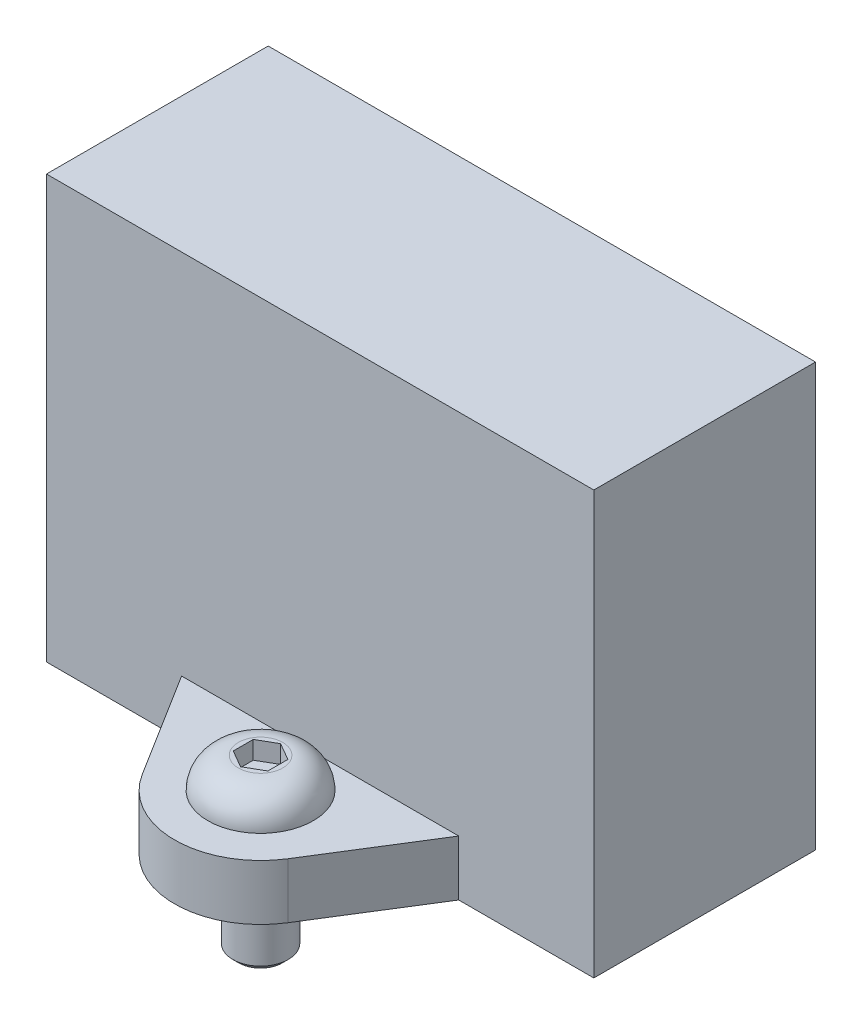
ISO-10303-21;
HEADER;
FILE_DESCRIPTION(('STEP AP214'),'2;1');
FILE_NAME('part.step','',(''),(''),'','','');
FILE_SCHEMA(('AUTOMOTIVE_DESIGN { 1 0 10303 214 1 1 1 1 }'));
ENDSEC;
DATA;
#1=APPLICATION_CONTEXT('core data for automotive mechanical design processes');
#2=APPLICATION_PROTOCOL_DEFINITION('international standard','automotive_design',2000,#1);
#3=PRODUCT_CONTEXT('',#1,'mechanical');
#4=PRODUCT('Part','Part','',(#3));
#5=PRODUCT_RELATED_PRODUCT_CATEGORY('part','',(#4));
#6=PRODUCT_DEFINITION_FORMATION('','',#4);
#7=PRODUCT_DEFINITION_CONTEXT('part definition',#1,'design');
#8=PRODUCT_DEFINITION('design','',#6,#7);
#9=PRODUCT_DEFINITION_SHAPE('','',#8);
#10=(LENGTH_UNIT() NAMED_UNIT(*) SI_UNIT(.MILLI.,.METRE.));
#11=(NAMED_UNIT(*) PLANE_ANGLE_UNIT() SI_UNIT($,.RADIAN.));
#12=(NAMED_UNIT(*) SI_UNIT($,.STERADIAN.) SOLID_ANGLE_UNIT());
#13=UNCERTAINTY_MEASURE_WITH_UNIT(LENGTH_MEASURE(1.E-05),#10,'distance_accuracy_value','');
#14=(GEOMETRIC_REPRESENTATION_CONTEXT(3) GLOBAL_UNCERTAINTY_ASSIGNED_CONTEXT((#13)) GLOBAL_UNIT_ASSIGNED_CONTEXT((#10,
#11,#12)) REPRESENTATION_CONTEXT('',''));
#15=CARTESIAN_POINT('',(0.,0.,0.));
#16=DIRECTION('',(0.,0.,1.));
#17=DIRECTION('',(1.,0.,0.));
#18=AXIS2_PLACEMENT_3D('',#15,#16,#17);
#19=CARTESIAN_POINT('',(-19.75,30.5,0.));
#20=DIRECTION('',(0.,0.,-1.));
#21=DIRECTION('',(-1.,0.,0.));
#22=AXIS2_PLACEMENT_3D('',#19,#20,#21);
#23=PLANE('',#22);
#24=DIRECTION('',(0.,-1.,0.));
#25=VECTOR('',#24,1.);
#26=CARTESIAN_POINT('',(-10.,4.,0.));
#27=LINE('',#26,#25);
#28=CARTESIAN_POINT('',(-10.,4.,0.));
#29=VERTEX_POINT('',#28);
#30=CARTESIAN_POINT('',(-10.,0.,0.));
#31=VERTEX_POINT('',#30);
#32=EDGE_CURVE('E224',#29,#31,#27,.T.);
#33=ORIENTED_EDGE('',*,*,#32,.F.);
#34=DIRECTION('',(-1.,0.,0.));
#35=VECTOR('',#34,1.);
#36=CARTESIAN_POINT('',(10.,4.,0.));
#37=LINE('',#36,#35);
#38=CARTESIAN_POINT('',(10.,4.,0.));
#39=VERTEX_POINT('',#38);
#40=EDGE_CURVE('E197',#39,#29,#37,.T.);
#41=ORIENTED_EDGE('',*,*,#40,.F.);
#42=DIRECTION('',(0.,-1.,0.));
#43=VECTOR('',#42,1.);
#44=CARTESIAN_POINT('',(10.,4.,0.));
#45=LINE('',#44,#43);
#46=CARTESIAN_POINT('',(10.,0.,0.));
#47=VERTEX_POINT('',#46);
#48=EDGE_CURVE('E206',#39,#47,#45,.T.);
#49=ORIENTED_EDGE('',*,*,#48,.T.);
#50=DIRECTION('',(1.,0.,0.));
#51=VECTOR('',#50,1.);
#52=CARTESIAN_POINT('',(-19.75,0.,0.));
#53=LINE('',#52,#51);
#54=CARTESIAN_POINT('',(19.75,0.,0.));
#55=VERTEX_POINT('',#54);
#56=EDGE_CURVE('E216',#47,#55,#53,.T.);
#57=ORIENTED_EDGE('',*,*,#56,.T.);
#58=DIRECTION('',(0.,-1.,0.));
#59=VECTOR('',#58,1.);
#60=CARTESIAN_POINT('',(19.75,30.5,0.));
#61=LINE('',#60,#59);
#62=CARTESIAN_POINT('',(19.75,30.5,0.));
#63=VERTEX_POINT('',#62);
#64=EDGE_CURVE('E25',#63,#55,#61,.T.);
#65=ORIENTED_EDGE('',*,*,#64,.F.);
#66=DIRECTION('',(1.,0.,0.));
#67=VECTOR('',#66,1.);
#68=CARTESIAN_POINT('',(-19.75,30.5,0.));
#69=LINE('',#68,#67);
#70=CARTESIAN_POINT('',(-19.75,30.5,0.));
#71=VERTEX_POINT('',#70);
#72=EDGE_CURVE('E242',#71,#63,#69,.T.);
#73=ORIENTED_EDGE('',*,*,#72,.F.);
#74=DIRECTION('',(0.,-1.,0.));
#75=VECTOR('',#74,1.);
#76=CARTESIAN_POINT('',(-19.75,30.5,0.));
#77=LINE('',#76,#75);
#78=CARTESIAN_POINT('',(-19.75,0.,0.));
#79=VERTEX_POINT('',#78);
#80=EDGE_CURVE('E11',#71,#79,#77,.T.);
#81=ORIENTED_EDGE('',*,*,#80,.T.);
#82=EDGE_CURVE('E254',#79,#31,#53,.T.);
#83=ORIENTED_EDGE('',*,*,#82,.T.);
#84=EDGE_LOOP('',(#33,#41,#49,#57,#65,#73,#81,#83));
#85=FACE_BOUND('',#84,.T.);
#86=ADVANCED_FACE('F16',(#85),#23,.F.);
#87=CARTESIAN_POINT('',(-19.75,30.5,-16.));
#88=DIRECTION('',(1.,0.,0.));
#89=DIRECTION('',(0.,0.,-1.));
#90=AXIS2_PLACEMENT_3D('',#87,#88,#89);
#91=PLANE('',#90);
#92=DIRECTION('',(0.,0.,1.));
#93=VECTOR('',#92,1.);
#94=CARTESIAN_POINT('',(-19.75,0.,-16.));
#95=LINE('',#94,#93);
#96=CARTESIAN_POINT('',(-19.75,0.,-16.));
#97=VERTEX_POINT('',#96);
#98=EDGE_CURVE('E226',#97,#79,#95,.T.);
#99=ORIENTED_EDGE('',*,*,#98,.T.);
#100=ORIENTED_EDGE('',*,*,#80,.F.);
#101=DIRECTION('',(0.,0.,1.));
#102=VECTOR('',#101,1.);
#103=CARTESIAN_POINT('',(-19.75,30.5,-16.));
#104=LINE('',#103,#102);
#105=CARTESIAN_POINT('',(-19.75,30.5,-16.));
#106=VERTEX_POINT('',#105);
#107=EDGE_CURVE('E239',#106,#71,#104,.T.);
#108=ORIENTED_EDGE('',*,*,#107,.F.);
#109=DIRECTION('',(0.,-1.,0.));
#110=VECTOR('',#109,1.);
#111=CARTESIAN_POINT('',(-19.75,30.5,-16.));
#112=LINE('',#111,#110);
#113=EDGE_CURVE('E248',#106,#97,#112,.T.);
#114=ORIENTED_EDGE('',*,*,#113,.T.);
#115=EDGE_LOOP('',(#99,#100,#108,#114));
#116=FACE_BOUND('',#115,.T.);
#117=ADVANCED_FACE('F18',(#116),#91,.F.);
#118=CARTESIAN_POINT('',(19.75,30.5,0.));
#119=DIRECTION('',(-1.,0.,0.));
#120=DIRECTION('',(0.,0.,1.));
#121=AXIS2_PLACEMENT_3D('',#118,#119,#120);
#122=PLANE('',#121);
#123=DIRECTION('',(0.,0.,-1.));
#124=VECTOR('',#123,1.);
#125=CARTESIAN_POINT('',(19.75,0.,0.));
#126=LINE('',#125,#124);
#127=CARTESIAN_POINT('',(19.75,0.,-16.));
#128=VERTEX_POINT('',#127);
#129=EDGE_CURVE('E251',#55,#128,#126,.T.);
#130=ORIENTED_EDGE('',*,*,#129,.T.);
#131=DIRECTION('',(0.,-1.,0.));
#132=VECTOR('',#131,1.);
#133=CARTESIAN_POINT('',(19.75,30.5,-16.));
#134=LINE('',#133,#132);
#135=CARTESIAN_POINT('',(19.75,30.5,-16.));
#136=VERTEX_POINT('',#135);
#137=EDGE_CURVE('E258',#136,#128,#134,.T.);
#138=ORIENTED_EDGE('',*,*,#137,.F.);
#139=DIRECTION('',(0.,0.,-1.));
#140=VECTOR('',#139,1.);
#141=CARTESIAN_POINT('',(19.75,30.5,0.));
#142=LINE('',#141,#140);
#143=EDGE_CURVE('E245',#63,#136,#142,.T.);
#144=ORIENTED_EDGE('',*,*,#143,.F.);
#145=ORIENTED_EDGE('',*,*,#64,.T.);
#146=EDGE_LOOP('',(#130,#138,#144,#145));
#147=FACE_BOUND('',#146,.T.);
#148=ADVANCED_FACE('F268',(#147),#122,.F.);
#149=CARTESIAN_POINT('',(19.75,30.5,-16.));
#150=DIRECTION('',(0.,0.,1.));
#151=DIRECTION('',(1.,0.,0.));
#152=AXIS2_PLACEMENT_3D('',#149,#150,#151);
#153=PLANE('',#152);
#154=DIRECTION('',(-1.,0.,0.));
#155=VECTOR('',#154,1.);
#156=CARTESIAN_POINT('',(19.75,0.,-16.));
#157=LINE('',#156,#155);
#158=EDGE_CURVE('E243',#128,#97,#157,.T.);
#159=ORIENTED_EDGE('',*,*,#158,.T.);
#160=ORIENTED_EDGE('',*,*,#113,.F.);
#161=DIRECTION('',(-1.,0.,0.));
#162=VECTOR('',#161,1.);
#163=CARTESIAN_POINT('',(19.75,30.5,-16.));
#164=LINE('',#163,#162);
#165=EDGE_CURVE('E247',#136,#106,#164,.T.);
#166=ORIENTED_EDGE('',*,*,#165,.F.);
#167=ORIENTED_EDGE('',*,*,#137,.T.);
#168=EDGE_LOOP('',(#159,#160,#166,#167));
#169=FACE_BOUND('',#168,.T.);
#170=ADVANCED_FACE('F274',(#169),#153,.F.);
#171=CARTESIAN_POINT('',(0.,30.5,0.));
#172=DIRECTION('',(0.,1.,0.));
#173=DIRECTION('',(0.,0.,1.));
#174=AXIS2_PLACEMENT_3D('',#171,#172,#173);
#175=PLANE('',#174);
#176=ORIENTED_EDGE('',*,*,#107,.T.);
#177=ORIENTED_EDGE('',*,*,#72,.T.);
#178=ORIENTED_EDGE('',*,*,#143,.T.);
#179=ORIENTED_EDGE('',*,*,#165,.T.);
#180=EDGE_LOOP('',(#176,#177,#178,#179));
#181=FACE_BOUND('',#180,.T.);
#182=ADVANCED_FACE('F281',(#181),#175,.T.);
#183=CARTESIAN_POINT('',(0.,0.,0.));
#184=DIRECTION('',(0.,1.,0.));
#185=DIRECTION('',(0.,0.,1.));
#186=AXIS2_PLACEMENT_3D('',#183,#184,#185);
#187=PLANE('',#186);
#188=CARTESIAN_POINT('',(0.,0.,4.3));
#189=DIRECTION('',(0.,1.,0.));
#190=DIRECTION('',(0.,0.,1.));
#191=AXIS2_PLACEMENT_3D('',#188,#189,#190);
#192=CIRCLE('',#191,2.15);
#193=CARTESIAN_POINT('',(0.,0.,6.45));
#194=VERTEX_POINT('',#193);
#195=EDGE_CURVE('E193',#194,#194,#192,.T.);
#196=ORIENTED_EDGE('',*,*,#195,.T.);
#197=EDGE_LOOP('',(#196));
#198=FACE_BOUND('',#197,.T.);
#199=ORIENTED_EDGE('',*,*,#98,.F.);
#200=ORIENTED_EDGE('',*,*,#158,.F.);
#201=ORIENTED_EDGE('',*,*,#129,.F.);
#202=ORIENTED_EDGE('',*,*,#56,.F.);
#203=DIRECTION('',(0.530092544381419,0.,-0.84793979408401));
#204=VECTOR('',#203,1.);
#205=CARTESIAN_POINT('',(5.25722672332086,0.,7.5865737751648));
#206=LINE('',#205,#204);
#207=CARTESIAN_POINT('',(5.25722672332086,0.,7.5865737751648));
#208=VERTEX_POINT('',#207);
#209=EDGE_CURVE('E41',#208,#47,#206,.T.);
#210=ORIENTED_EDGE('',*,*,#209,.F.);
#211=CARTESIAN_POINT('',(0.,0.,4.3));
#212=DIRECTION('',(0.,1.,0.));
#213=DIRECTION('',(0.,0.,1.));
#214=AXIS2_PLACEMENT_3D('',#211,#212,#213);
#215=CIRCLE('',#214,6.2);
#216=CARTESIAN_POINT('',(-5.25722672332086,0.,7.5865737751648));
#217=VERTEX_POINT('',#216);
#218=EDGE_CURVE('E207',#217,#208,#215,.T.);
#219=ORIENTED_EDGE('',*,*,#218,.F.);
#220=DIRECTION('',(0.530092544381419,0.,0.84793979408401));
#221=VECTOR('',#220,1.);
#222=CARTESIAN_POINT('',(-10.,0.,0.));
#223=LINE('',#222,#221);
#224=EDGE_CURVE('E196',#31,#217,#223,.T.);
#225=ORIENTED_EDGE('',*,*,#224,.F.);
#226=ORIENTED_EDGE('',*,*,#82,.F.);
#227=EDGE_LOOP('',(#199,#200,#201,#202,#210,#219,#225,#226));
#228=FACE_BOUND('',#227,.T.);
#229=ADVANCED_FACE('F276',(#198,#228),#187,.F.);
#230=CARTESIAN_POINT('',(-10.,4.,0.));
#231=DIRECTION('',(0.84793979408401,0.,-0.530092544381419));
#232=DIRECTION('',(-0.530092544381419,0.,-0.84793979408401));
#233=AXIS2_PLACEMENT_3D('',#230,#231,#232);
#234=PLANE('',#233);
#235=ORIENTED_EDGE('',*,*,#224,.T.);
#236=DIRECTION('',(0.,-1.,0.));
#237=VECTOR('',#236,1.);
#238=CARTESIAN_POINT('',(-5.25722672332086,4.,7.5865737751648));
#239=LINE('',#238,#237);
#240=CARTESIAN_POINT('',(-5.25722672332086,4.,7.5865737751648));
#241=VERTEX_POINT('',#240);
#242=EDGE_CURVE('E227',#241,#217,#239,.T.);
#243=ORIENTED_EDGE('',*,*,#242,.F.);
#244=DIRECTION('',(0.530092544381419,0.,0.84793979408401));
#245=VECTOR('',#244,1.);
#246=CARTESIAN_POINT('',(-10.,4.,0.));
#247=LINE('',#246,#245);
#248=EDGE_CURVE('E200',#29,#241,#247,.T.);
#249=ORIENTED_EDGE('',*,*,#248,.F.);
#250=ORIENTED_EDGE('',*,*,#32,.T.);
#251=EDGE_LOOP('',(#235,#243,#249,#250));
#252=FACE_BOUND('',#251,.T.);
#253=ADVANCED_FACE('F290',(#252),#234,.F.);
#254=CARTESIAN_POINT('',(0.,4.,4.3));
#255=DIRECTION('',(0.,-1.,0.));
#256=DIRECTION('',(0.,0.,-1.));
#257=AXIS2_PLACEMENT_3D('',#254,#255,#256);
#258=CYLINDRICAL_SURFACE('',#257,6.2);
#259=ORIENTED_EDGE('',*,*,#218,.T.);
#260=DIRECTION('',(0.,-1.,0.));
#261=VECTOR('',#260,1.);
#262=CARTESIAN_POINT('',(5.25722672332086,4.,7.5865737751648));
#263=LINE('',#262,#261);
#264=CARTESIAN_POINT('',(5.25722672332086,4.,7.5865737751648));
#265=VERTEX_POINT('',#264);
#266=EDGE_CURVE('E211',#265,#208,#263,.T.);
#267=ORIENTED_EDGE('',*,*,#266,.F.);
#268=CARTESIAN_POINT('',(0.,4.,4.3));
#269=DIRECTION('',(0.,1.,0.));
#270=DIRECTION('',(0.,0.,1.));
#271=AXIS2_PLACEMENT_3D('',#268,#269,#270);
#272=CIRCLE('',#271,6.2);
#273=EDGE_CURVE('E202',#241,#265,#272,.T.);
#274=ORIENTED_EDGE('',*,*,#273,.F.);
#275=ORIENTED_EDGE('',*,*,#242,.T.);
#276=EDGE_LOOP('',(#259,#267,#274,#275));
#277=FACE_BOUND('',#276,.T.);
#278=ADVANCED_FACE('F285',(#277),#258,.T.);
#279=CARTESIAN_POINT('',(5.25722672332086,4.,7.5865737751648));
#280=DIRECTION('',(-0.84793979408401,0.,-0.530092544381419));
#281=DIRECTION('',(-0.530092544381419,0.,0.84793979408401));
#282=AXIS2_PLACEMENT_3D('',#279,#280,#281);
#283=PLANE('',#282);
#284=ORIENTED_EDGE('',*,*,#209,.T.);
#285=ORIENTED_EDGE('',*,*,#48,.F.);
#286=DIRECTION('',(0.530092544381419,0.,-0.84793979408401));
#287=VECTOR('',#286,1.);
#288=CARTESIAN_POINT('',(5.25722672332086,4.,7.5865737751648));
#289=LINE('',#288,#287);
#290=EDGE_CURVE('E204',#265,#39,#289,.T.);
#291=ORIENTED_EDGE('',*,*,#290,.F.);
#292=ORIENTED_EDGE('',*,*,#266,.T.);
#293=EDGE_LOOP('',(#284,#285,#291,#292));
#294=FACE_BOUND('',#293,.T.);
#295=ADVANCED_FACE('F287',(#294),#283,.F.);
#296=CARTESIAN_POINT('',(0.,4.,4.3));
#297=DIRECTION('',(0.,1.,0.));
#298=DIRECTION('',(0.,0.,1.));
#299=AXIS2_PLACEMENT_3D('',#296,#297,#298);
#300=PLANE('',#299);
#301=CARTESIAN_POINT('',(0.,4.,4.3));
#302=DIRECTION('',(0.,1.,0.));
#303=DIRECTION('',(0.,0.,1.));
#304=AXIS2_PLACEMENT_3D('',#301,#302,#303);
#305=CIRCLE('',#304,3.8);
#306=CARTESIAN_POINT('',(0.,4.,8.1));
#307=VERTEX_POINT('',#306);
#308=EDGE_CURVE('E184',#307,#307,#305,.T.);
#309=ORIENTED_EDGE('',*,*,#308,.F.);
#310=EDGE_LOOP('',(#309));
#311=FACE_BOUND('',#310,.T.);
#312=ORIENTED_EDGE('',*,*,#40,.T.);
#313=ORIENTED_EDGE('',*,*,#248,.T.);
#314=ORIENTED_EDGE('',*,*,#273,.T.);
#315=ORIENTED_EDGE('',*,*,#290,.T.);
#316=EDGE_LOOP('',(#312,#313,#314,#315));
#317=FACE_BOUND('',#316,.T.);
#318=ADVANCED_FACE('F289',(#311,#317),#300,.T.);
#319=CARTESIAN_POINT('',(0.,0.,4.3));
#320=DIRECTION('',(0.,1.,0.));
#321=DIRECTION('',(0.,0.,1.));
#322=AXIS2_PLACEMENT_3D('',#319,#320,#321);
#323=CYLINDRICAL_SURFACE('',#322,2.15);
#324=CARTESIAN_POINT('',(0.,4.,4.3));
#325=DIRECTION('',(0.,1.,0.));
#326=DIRECTION('',(0.,0.,1.));
#327=AXIS2_PLACEMENT_3D('',#324,#325,#326);
#328=CIRCLE('',#327,2.15);
#329=CARTESIAN_POINT('',(0.,4.,6.45));
#330=VERTEX_POINT('',#329);
#331=EDGE_CURVE('E190',#330,#330,#328,.T.);
#332=ORIENTED_EDGE('',*,*,#331,.T.);
#333=EDGE_LOOP('',(#332));
#334=FACE_BOUND('',#333,.T.);
#335=ORIENTED_EDGE('',*,*,#195,.F.);
#336=EDGE_LOOP('',(#335));
#337=FACE_BOUND('',#336,.T.);
#338=ADVANCED_FACE('F359',(#334,#337),#323,.F.);
#339=CARTESIAN_POINT('',(1.5705,-6.,4.3));
#340=DIRECTION('',(0.,1.,0.));
#341=DIRECTION('',(0.,0.,1.));
#342=AXIS2_PLACEMENT_3D('',#339,#340,#341);
#343=PLANE('',#342);
#344=CARTESIAN_POINT('',(0.,-6.,4.3));
#345=DIRECTION('',(0.,1.,0.));
#346=DIRECTION('',(0.,0.,1.));
#347=AXIS2_PLACEMENT_3D('',#344,#345,#346);
#348=CIRCLE('',#347,1.5705);
#349=CARTESIAN_POINT('',(0.,-6.,5.8705));
#350=VERTEX_POINT('',#349);
#351=EDGE_CURVE('E168',#350,#350,#348,.T.);
#352=ORIENTED_EDGE('',*,*,#351,.F.);
#353=EDGE_LOOP('',(#352));
#354=FACE_BOUND('',#353,.T.);
#355=ADVANCED_FACE('F371',(#354),#343,.F.);
#356=CARTESIAN_POINT('',(0.,-6.,4.3));
#357=DIRECTION('',(0.,1.,0.));
#358=DIRECTION('',(0.,0.,1.));
#359=AXIS2_PLACEMENT_3D('',#356,#357,#358);
#360=CONICAL_SURFACE('',#359,1.5705,0.785398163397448);
#361=CARTESIAN_POINT('',(0.,-5.5705,4.3));
#362=DIRECTION('',(0.,1.,0.));
#363=DIRECTION('',(0.,0.,1.));
#364=AXIS2_PLACEMENT_3D('',#361,#362,#363);
#365=CIRCLE('',#364,2.);
#366=CARTESIAN_POINT('',(0.,-5.5705,6.3));
#367=VERTEX_POINT('',#366);
#368=EDGE_CURVE('E178',#367,#367,#365,.T.);
#369=ORIENTED_EDGE('',*,*,#368,.F.);
#370=EDGE_LOOP('',(#369));
#371=FACE_BOUND('',#370,.T.);
#372=ORIENTED_EDGE('',*,*,#351,.T.);
#373=EDGE_LOOP('',(#372));
#374=FACE_BOUND('',#373,.T.);
#375=ADVANCED_FACE('F383',(#371,#374),#360,.T.);
#376=CARTESIAN_POINT('',(0.,-6.,4.3));
#377=DIRECTION('',(0.,1.,0.));
#378=DIRECTION('',(0.,0.,1.));
#379=AXIS2_PLACEMENT_3D('',#376,#377,#378);
#380=CYLINDRICAL_SURFACE('',#379,2.);
#381=CARTESIAN_POINT('',(0.,4.,4.3));
#382=DIRECTION('',(0.,1.,0.));
#383=DIRECTION('',(0.,0.,1.));
#384=AXIS2_PLACEMENT_3D('',#381,#382,#383);
#385=CIRCLE('',#384,2.);
#386=CARTESIAN_POINT('',(0.,4.,6.3));
#387=VERTEX_POINT('',#386);
#388=EDGE_CURVE('E181',#387,#387,#385,.T.);
#389=ORIENTED_EDGE('',*,*,#388,.F.);
#390=EDGE_LOOP('',(#389));
#391=FACE_BOUND('',#390,.T.);
#392=ORIENTED_EDGE('',*,*,#368,.T.);
#393=EDGE_LOOP('',(#392));
#394=FACE_BOUND('',#393,.T.);
#395=ADVANCED_FACE('F393',(#391,#394),#380,.T.);
#396=CARTESIAN_POINT('',(3.8,4.,4.3));
#397=DIRECTION('',(0.,1.,0.));
#398=DIRECTION('',(0.,0.,1.));
#399=AXIS2_PLACEMENT_3D('',#396,#397,#398);
#400=PLANE('',#399);
#401=ORIENTED_EDGE('',*,*,#388,.T.);
#402=EDGE_LOOP('',(#401));
#403=FACE_BOUND('',#402,.T.);
#404=ORIENTED_EDGE('',*,*,#331,.F.);
#405=EDGE_LOOP('',(#404));
#406=FACE_BOUND('',#405,.T.);
#407=ADVANCED_FACE('F405',(#403,#406),#400,.F.);
#408=CARTESIAN_POINT('',(0.,6.2,4.3));
#409=DIRECTION('',(0.,-1.,0.));
#410=DIRECTION('',(0.,0.,-1.));
#411=AXIS2_PLACEMENT_3D('',#408,#409,#410);
#412=PLANE('',#411);
#413=DIRECTION('',(0.,0.,1.));
#414=VECTOR('',#413,1.);
#415=CARTESIAN_POINT('',(-1.25,6.2,3.57831216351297));
#416=LINE('',#415,#414);
#417=CARTESIAN_POINT('',(-1.25,6.2,3.57831216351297));
#418=VERTEX_POINT('',#417);
#419=CARTESIAN_POINT('',(-1.25,6.2,5.02168783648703));
#420=VERTEX_POINT('',#419);
#421=EDGE_CURVE('E156',#418,#420,#416,.T.);
#422=ORIENTED_EDGE('',*,*,#421,.F.);
#423=DIRECTION('',(-0.866025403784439,0.,0.5));
#424=VECTOR('',#423,1.);
#425=CARTESIAN_POINT('',(0.,6.2,2.85662432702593));
#426=LINE('',#425,#424);
#427=CARTESIAN_POINT('',(0.,6.2,2.85662432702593));
#428=VERTEX_POINT('',#427);
#429=EDGE_CURVE('E33',#428,#418,#426,.T.);
#430=ORIENTED_EDGE('',*,*,#429,.F.);
#431=DIRECTION('',(-0.866025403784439,0.,-0.5));
#432=VECTOR('',#431,1.);
#433=CARTESIAN_POINT('',(1.25,6.2,3.57831216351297));
#434=LINE('',#433,#432);
#435=CARTESIAN_POINT('',(1.25,6.2,3.57831216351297));
#436=VERTEX_POINT('',#435);
#437=EDGE_CURVE('E142',#436,#428,#434,.T.);
#438=ORIENTED_EDGE('',*,*,#437,.F.);
#439=DIRECTION('',(0.,0.,-1.));
#440=VECTOR('',#439,1.);
#441=CARTESIAN_POINT('',(1.25,6.2,5.02168783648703));
#442=LINE('',#441,#440);
#443=CARTESIAN_POINT('',(1.25,6.2,5.02168783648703));
#444=VERTEX_POINT('',#443);
#445=EDGE_CURVE('E145',#444,#436,#442,.T.);
#446=ORIENTED_EDGE('',*,*,#445,.F.);
#447=DIRECTION('',(0.866025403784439,0.,-0.5));
#448=VECTOR('',#447,1.);
#449=CARTESIAN_POINT('',(0.,6.2,5.74337567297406));
#450=LINE('',#449,#448);
#451=CARTESIAN_POINT('',(0.,6.2,5.74337567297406));
#452=VERTEX_POINT('',#451);
#453=EDGE_CURVE('E161',#452,#444,#450,.T.);
#454=ORIENTED_EDGE('',*,*,#453,.F.);
#455=DIRECTION('',(0.866025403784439,0.,0.5));
#456=VECTOR('',#455,1.);
#457=CARTESIAN_POINT('',(-1.25,6.2,5.02168783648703));
#458=LINE('',#457,#456);
#459=EDGE_CURVE('E158',#420,#452,#458,.T.);
#460=ORIENTED_EDGE('',*,*,#459,.F.);
#461=EDGE_LOOP('',(#422,#430,#438,#446,#454,#460));
#462=FACE_BOUND('',#461,.T.);
#463=CARTESIAN_POINT('',(0.,6.2,4.3));
#464=DIRECTION('',(0.,1.,0.));
#465=DIRECTION('',(0.,0.,1.));
#466=AXIS2_PLACEMENT_3D('',#463,#464,#465);
#467=CIRCLE('',#466,1.6);
#468=CARTESIAN_POINT('',(0.,6.2,5.9));
#469=VERTEX_POINT('',#468);
#470=EDGE_CURVE('E187',#469,#469,#467,.T.);
#471=ORIENTED_EDGE('',*,*,#470,.T.);
#472=EDGE_LOOP('',(#471));
#473=FACE_BOUND('',#472,.T.);
#474=ADVANCED_FACE('F416',(#462,#473),#412,.F.);
#475=CARTESIAN_POINT('',(0.,4.,4.3));
#476=DIRECTION('',(0.,1.,0.));
#477=DIRECTION('',(0.,0.,1.));
#478=AXIS2_PLACEMENT_3D('',#475,#476,#477);
#479=DEGENERATE_TOROIDAL_SURFACE('',#478,1.6,2.2,.T.);
#480=ORIENTED_EDGE('',*,*,#470,.F.);
#481=EDGE_LOOP('',(#480));
#482=FACE_BOUND('',#481,.T.);
#483=ORIENTED_EDGE('',*,*,#308,.T.);
#484=EDGE_LOOP('',(#483));
#485=FACE_BOUND('',#484,.T.);
#486=ADVANCED_FACE('F426',(#482,#485),#479,.T.);
#487=CARTESIAN_POINT('',(0.,4.9,2.85662432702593));
#488=DIRECTION('',(-0.5,0.,-0.866025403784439));
#489=DIRECTION('',(-0.866025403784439,0.,0.5));
#490=AXIS2_PLACEMENT_3D('',#487,#488,#489);
#491=PLANE('',#490);
#492=ORIENTED_EDGE('',*,*,#429,.T.);
#493=DIRECTION('',(0.,1.,0.));
#494=VECTOR('',#493,1.);
#495=CARTESIAN_POINT('',(-1.25,4.9,3.57831216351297));
#496=LINE('',#495,#494);
#497=CARTESIAN_POINT('',(-1.25,4.9,3.57831216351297));
#498=VERTEX_POINT('',#497);
#499=EDGE_CURVE('E119',#498,#418,#496,.T.);
#500=ORIENTED_EDGE('',*,*,#499,.F.);
#501=DIRECTION('',(-0.866025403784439,0.,0.5));
#502=VECTOR('',#501,1.);
#503=CARTESIAN_POINT('',(0.,4.9,2.85662432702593));
#504=LINE('',#503,#502);
#505=CARTESIAN_POINT('',(0.,4.9,2.85662432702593));
#506=VERTEX_POINT('',#505);
#507=EDGE_CURVE('E123',#506,#498,#504,.T.);
#508=ORIENTED_EDGE('',*,*,#507,.F.);
#509=DIRECTION('',(0.,1.,0.));
#510=VECTOR('',#509,1.);
#511=CARTESIAN_POINT('',(0.,4.9,2.85662432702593));
#512=LINE('',#511,#510);
#513=EDGE_CURVE('E166',#506,#428,#512,.T.);
#514=ORIENTED_EDGE('',*,*,#513,.T.);
#515=EDGE_LOOP('',(#492,#500,#508,#514));
#516=FACE_BOUND('',#515,.T.);
#517=ADVANCED_FACE('F121',(#516),#491,.F.);
#518=CARTESIAN_POINT('',(1.25,4.9,3.57831216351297));
#519=DIRECTION('',(0.5,0.,-0.866025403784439));
#520=DIRECTION('',(-0.866025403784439,0.,-0.5));
#521=AXIS2_PLACEMENT_3D('',#518,#519,#520);
#522=PLANE('',#521);
#523=ORIENTED_EDGE('',*,*,#437,.T.);
#524=ORIENTED_EDGE('',*,*,#513,.F.);
#525=DIRECTION('',(-0.866025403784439,0.,-0.5));
#526=VECTOR('',#525,1.);
#527=CARTESIAN_POINT('',(1.25,4.9,3.57831216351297));
#528=LINE('',#527,#526);
#529=CARTESIAN_POINT('',(1.25,4.9,3.57831216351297));
#530=VERTEX_POINT('',#529);
#531=EDGE_CURVE('E129',#530,#506,#528,.T.);
#532=ORIENTED_EDGE('',*,*,#531,.F.);
#533=DIRECTION('',(0.,1.,0.));
#534=VECTOR('',#533,1.);
#535=CARTESIAN_POINT('',(1.25,4.9,3.57831216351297));
#536=LINE('',#535,#534);
#537=EDGE_CURVE('E169',#530,#436,#536,.T.);
#538=ORIENTED_EDGE('',*,*,#537,.T.);
#539=EDGE_LOOP('',(#523,#524,#532,#538));
#540=FACE_BOUND('',#539,.T.);
#541=ADVANCED_FACE('F449',(#540),#522,.F.);
#542=CARTESIAN_POINT('',(1.25,4.9,5.02168783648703));
#543=DIRECTION('',(1.,0.,0.));
#544=DIRECTION('',(0.,0.,-1.));
#545=AXIS2_PLACEMENT_3D('',#542,#543,#544);
#546=PLANE('',#545);
#547=ORIENTED_EDGE('',*,*,#445,.T.);
#548=ORIENTED_EDGE('',*,*,#537,.F.);
#549=DIRECTION('',(0.,0.,-1.));
#550=VECTOR('',#549,1.);
#551=CARTESIAN_POINT('',(1.25,4.9,5.02168783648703));
#552=LINE('',#551,#550);
#553=CARTESIAN_POINT('',(1.25,4.9,5.02168783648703));
#554=VERTEX_POINT('',#553);
#555=EDGE_CURVE('E152',#554,#530,#552,.T.);
#556=ORIENTED_EDGE('',*,*,#555,.F.);
#557=DIRECTION('',(0.,1.,0.));
#558=VECTOR('',#557,1.);
#559=CARTESIAN_POINT('',(1.25,4.9,5.02168783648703));
#560=LINE('',#559,#558);
#561=EDGE_CURVE('E171',#554,#444,#560,.T.);
#562=ORIENTED_EDGE('',*,*,#561,.T.);
#563=EDGE_LOOP('',(#547,#548,#556,#562));
#564=FACE_BOUND('',#563,.T.);
#565=ADVANCED_FACE('F458',(#564),#546,.F.);
#566=CARTESIAN_POINT('',(0.,4.9,5.74337567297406));
#567=DIRECTION('',(0.5,0.,0.866025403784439));
#568=DIRECTION('',(0.866025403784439,0.,-0.5));
#569=AXIS2_PLACEMENT_3D('',#566,#567,#568);
#570=PLANE('',#569);
#571=ORIENTED_EDGE('',*,*,#453,.T.);
#572=ORIENTED_EDGE('',*,*,#561,.F.);
#573=DIRECTION('',(0.866025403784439,0.,-0.5));
#574=VECTOR('',#573,1.);
#575=CARTESIAN_POINT('',(0.,4.9,5.74337567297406));
#576=LINE('',#575,#574);
#577=CARTESIAN_POINT('',(0.,4.9,5.74337567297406));
#578=VERTEX_POINT('',#577);
#579=EDGE_CURVE('E149',#578,#554,#576,.T.);
#580=ORIENTED_EDGE('',*,*,#579,.F.);
#581=DIRECTION('',(0.,1.,0.));
#582=VECTOR('',#581,1.);
#583=CARTESIAN_POINT('',(0.,4.9,5.74337567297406));
#584=LINE('',#583,#582);
#585=EDGE_CURVE('E173',#578,#452,#584,.T.);
#586=ORIENTED_EDGE('',*,*,#585,.T.);
#587=EDGE_LOOP('',(#571,#572,#580,#586));
#588=FACE_BOUND('',#587,.T.);
#589=ADVANCED_FACE('F468',(#588),#570,.F.);
#590=CARTESIAN_POINT('',(-1.25,4.9,5.02168783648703));
#591=DIRECTION('',(-0.5,0.,0.866025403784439));
#592=DIRECTION('',(0.866025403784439,0.,0.5));
#593=AXIS2_PLACEMENT_3D('',#590,#591,#592);
#594=PLANE('',#593);
#595=ORIENTED_EDGE('',*,*,#459,.T.);
#596=ORIENTED_EDGE('',*,*,#585,.F.);
#597=DIRECTION('',(0.866025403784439,0.,0.5));
#598=VECTOR('',#597,1.);
#599=CARTESIAN_POINT('',(-1.25,4.9,5.02168783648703));
#600=LINE('',#599,#598);
#601=CARTESIAN_POINT('',(-1.25,4.9,5.02168783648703));
#602=VERTEX_POINT('',#601);
#603=EDGE_CURVE('E137',#602,#578,#600,.T.);
#604=ORIENTED_EDGE('',*,*,#603,.F.);
#605=DIRECTION('',(0.,1.,0.));
#606=VECTOR('',#605,1.);
#607=CARTESIAN_POINT('',(-1.25,4.9,5.02168783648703));
#608=LINE('',#607,#606);
#609=EDGE_CURVE('E128',#602,#420,#608,.T.);
#610=ORIENTED_EDGE('',*,*,#609,.T.);
#611=EDGE_LOOP('',(#595,#596,#604,#610));
#612=FACE_BOUND('',#611,.T.);
#613=ADVANCED_FACE('F479',(#612),#594,.F.);
#614=CARTESIAN_POINT('',(-1.25,4.9,3.57831216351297));
#615=DIRECTION('',(-1.,0.,0.));
#616=DIRECTION('',(0.,0.,1.));
#617=AXIS2_PLACEMENT_3D('',#614,#615,#616);
#618=PLANE('',#617);
#619=ORIENTED_EDGE('',*,*,#421,.T.);
#620=ORIENTED_EDGE('',*,*,#609,.F.);
#621=DIRECTION('',(0.,0.,1.));
#622=VECTOR('',#621,1.);
#623=CARTESIAN_POINT('',(-1.25,4.9,3.57831216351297));
#624=LINE('',#623,#622);
#625=EDGE_CURVE('E132',#498,#602,#624,.T.);
#626=ORIENTED_EDGE('',*,*,#625,.F.);
#627=ORIENTED_EDGE('',*,*,#499,.T.);
#628=EDGE_LOOP('',(#619,#620,#626,#627));
#629=FACE_BOUND('',#628,.T.);
#630=ADVANCED_FACE('F133',(#629),#618,.F.);
#631=CARTESIAN_POINT('',(0.,4.9,0.));
#632=DIRECTION('',(0.,1.,0.));
#633=DIRECTION('',(0.,0.,1.));
#634=AXIS2_PLACEMENT_3D('',#631,#632,#633);
#635=PLANE('',#634);
#636=ORIENTED_EDGE('',*,*,#507,.T.);
#637=ORIENTED_EDGE('',*,*,#625,.T.);
#638=ORIENTED_EDGE('',*,*,#603,.T.);
#639=ORIENTED_EDGE('',*,*,#579,.T.);
#640=ORIENTED_EDGE('',*,*,#555,.T.);
#641=ORIENTED_EDGE('',*,*,#531,.T.);
#642=EDGE_LOOP('',(#636,#637,#638,#639,#640,#641));
#643=FACE_BOUND('',#642,.T.);
#644=ADVANCED_FACE('F139',(#643),#635,.T.);
#645=CLOSED_SHELL('',(#86,#117,#148,#170,#182,#229,#253,#278,#295,#318,#338,#355,#375,#395,#407,
#474,#486,#517,#541,#565,#589,#613,#630,#644));
#646=MANIFOLD_SOLID_BREP('B1',#645);
#647=ADVANCED_BREP_SHAPE_REPRESENTATION('',(#18,#646),#14);
#648=SHAPE_DEFINITION_REPRESENTATION(#9,#647);
ENDSEC;
END-ISO-10303-21;
